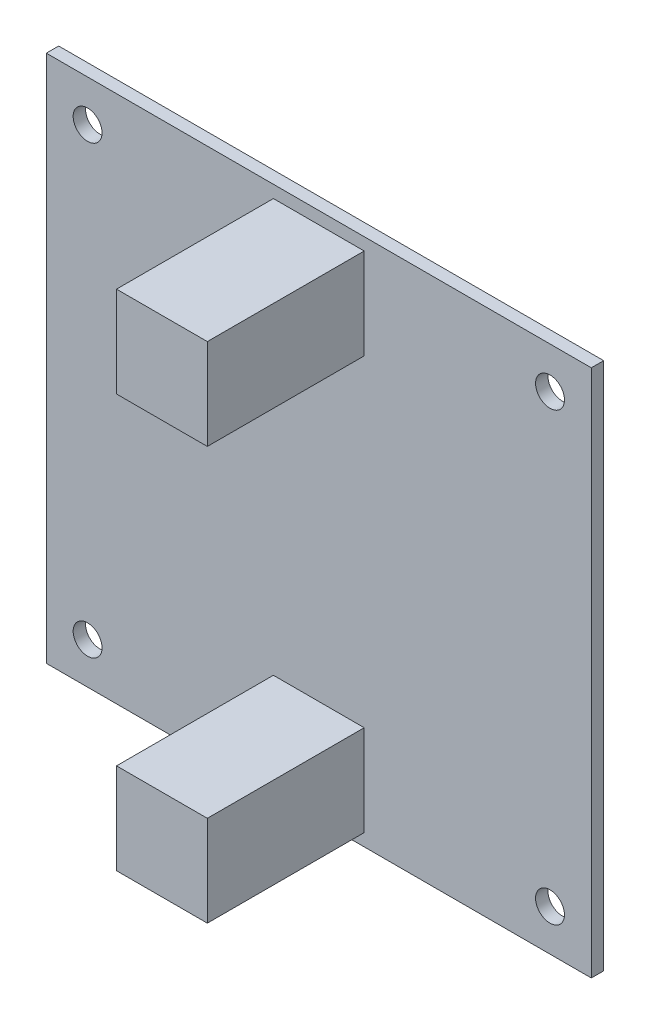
from build123d import *

# Parameters (mm, degrees)
SKETCH1_W           = 66
SKETCH1_H           = 64
BOSS_EXTRUDE1_DEPTH = 1.5
CUT_EXTRUDE1_REACH  = 47.992
SKETCH2_R           = 1.75
SKETCH4_W           = 11
SKETCH4_H           = 11
BOSS_EXTRUDE2_DEPTH = 19


with BuildPart() as part:
    # Sketch1 → Boss-Extrude1 (new body)
    with BuildSketch(Plane.XY):
        Rectangle(SKETCH1_W, SKETCH1_H)
    extrude(amount=BOSS_EXTRUDE1_DEPTH)

    # Sketch2 → Cut-Extrude1 (cut, up to next)
    with BuildSketch(Plane.XY.offset(1.5), mode=Mode.PRIVATE) as cut_extrude1_sk1:
        with Locations((-28, 27)):
            Circle(SKETCH2_R)
    cut_extrude1_tool1 = extrude(cut_extrude1_sk1.sketch, amount=-CUT_EXTRUDE1_REACH, mode=Mode.PRIVATE) & part.part
    # Sketch2 → Cut-Extrude1 (cut, up to next)
    with BuildSketch(Plane.XY.offset(1.5), mode=Mode.PRIVATE) as cut_extrude1_sk2:
        with Locations((28, 27)):
            Circle(SKETCH2_R)
    cut_extrude1_tool2 = extrude(cut_extrude1_sk2.sketch, amount=-CUT_EXTRUDE1_REACH, mode=Mode.PRIVATE) & part.part
    # Sketch2 → Cut-Extrude1 (cut, up to next)
    with BuildSketch(Plane.XY.offset(1.5), mode=Mode.PRIVATE) as cut_extrude1_sk3:
        with Locations((28, -27)):
            Circle(SKETCH2_R)
    cut_extrude1_tool3 = extrude(cut_extrude1_sk3.sketch, amount=-CUT_EXTRUDE1_REACH, mode=Mode.PRIVATE) & part.part
    # Sketch2 → Cut-Extrude1 (cut, up to next)
    with BuildSketch(Plane.XY.offset(1.5), mode=Mode.PRIVATE) as cut_extrude1_sk4:
        with Locations((-28, -27)):
            Circle(SKETCH2_R)
    cut_extrude1_tool4 = extrude(cut_extrude1_sk4.sketch, amount=-CUT_EXTRUDE1_REACH, mode=Mode.PRIVATE) & part.part
    add(cut_extrude1_tool1.solids().sort_by_distance((-28, 27, 1.5))[0], mode=Mode.SUBTRACT)
    add(cut_extrude1_tool2.solids().sort_by_distance((28, 27, 1.5))[0], mode=Mode.SUBTRACT)
    add(cut_extrude1_tool3.solids().sort_by_distance((28, -27, 1.5))[0], mode=Mode.SUBTRACT)
    add(cut_extrude1_tool4.solids().sort_by_distance((-28, -27, 1.5))[0], mode=Mode.SUBTRACT)

    # Sketch4 → Boss-Extrude2 (add)
    with BuildSketch(Plane.XY.offset(1.5)):
        with Locations((0, 25)):
            Rectangle(SKETCH4_W, SKETCH4_H)
    boss_extrude2 = extrude(amount=BOSS_EXTRUDE2_DEPTH)

    # Mirror1: Boss-Extrude2 across plane
    add(boss_extrude2.mirror(Plane.ZX))


solid = part.part
